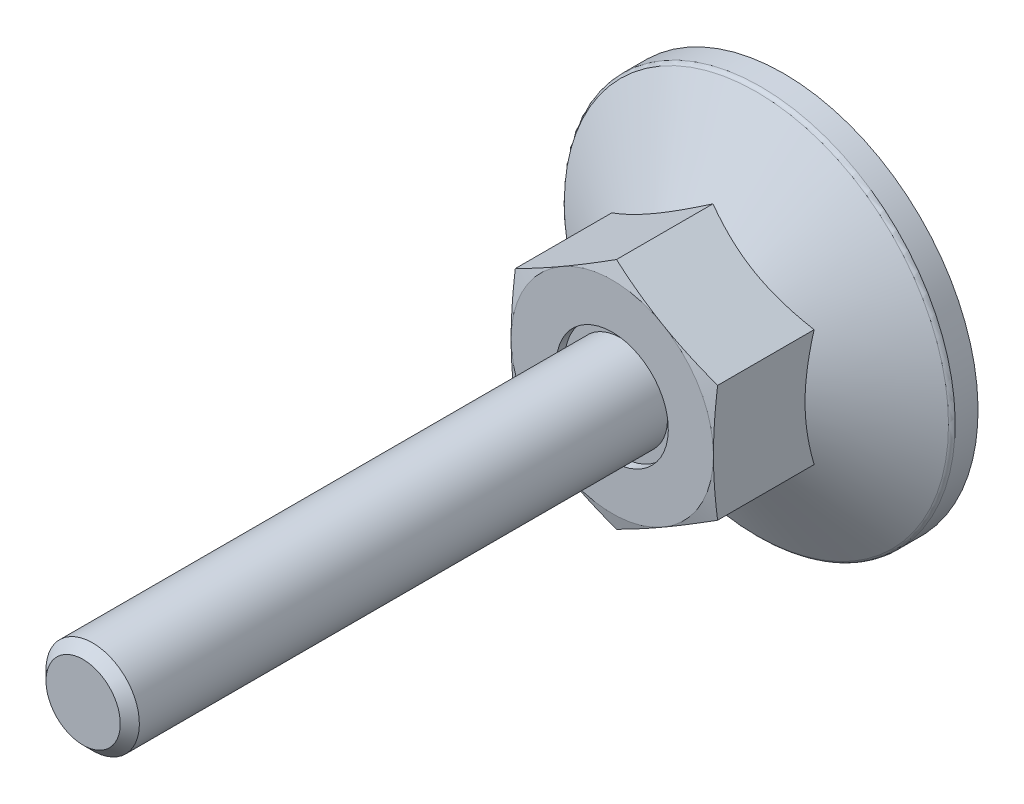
ISO-10303-21;
HEADER;
FILE_DESCRIPTION(('STEP AP214'),'2;1');
FILE_NAME('part.step','',(''),(''),'','','');
FILE_SCHEMA(('AUTOMOTIVE_DESIGN { 1 0 10303 214 1 1 1 1 }'));
ENDSEC;
DATA;
#1=APPLICATION_CONTEXT('core data for automotive mechanical design processes');
#2=APPLICATION_PROTOCOL_DEFINITION('international standard','automotive_design',2000,#1);
#3=PRODUCT_CONTEXT('',#1,'mechanical');
#4=PRODUCT('Part','Part','',(#3));
#5=PRODUCT_RELATED_PRODUCT_CATEGORY('part','',(#4));
#6=PRODUCT_DEFINITION_FORMATION('','',#4);
#7=PRODUCT_DEFINITION_CONTEXT('part definition',#1,'design');
#8=PRODUCT_DEFINITION('design','',#6,#7);
#9=PRODUCT_DEFINITION_SHAPE('','',#8);
#10=(LENGTH_UNIT() NAMED_UNIT(*) SI_UNIT(.MILLI.,.METRE.));
#11=(NAMED_UNIT(*) PLANE_ANGLE_UNIT() SI_UNIT($,.RADIAN.));
#12=(NAMED_UNIT(*) SI_UNIT($,.STERADIAN.) SOLID_ANGLE_UNIT());
#13=UNCERTAINTY_MEASURE_WITH_UNIT(LENGTH_MEASURE(1.E-05),#10,'distance_accuracy_value','');
#14=(GEOMETRIC_REPRESENTATION_CONTEXT(3) GLOBAL_UNCERTAINTY_ASSIGNED_CONTEXT((#13)) GLOBAL_UNIT_ASSIGNED_CONTEXT((#10,
#11,#12)) REPRESENTATION_CONTEXT('',''));
#15=CARTESIAN_POINT('',(0.,0.,0.));
#16=DIRECTION('',(0.,0.,1.));
#17=DIRECTION('',(1.,0.,0.));
#18=AXIS2_PLACEMENT_3D('',#15,#16,#17);
#19=CARTESIAN_POINT('',(0.,0.,10.45));
#20=DIRECTION('',(0.,0.,-1.));
#21=DIRECTION('',(0.,1.,0.));
#22=AXIS2_PLACEMENT_3D('',#19,#20,#21);
#23=PLANE('',#22);
#24=CARTESIAN_POINT('',(0.,0.,10.45));
#25=DIRECTION('',(0.,0.,-1.));
#26=DIRECTION('',(0.,1.,0.));
#27=AXIS2_PLACEMENT_3D('',#24,#25,#26);
#28=CIRCLE('',#27,3.6);
#29=CARTESIAN_POINT('',(0.,3.6,10.45));
#30=VERTEX_POINT('',#29);
#31=EDGE_CURVE('E27',#30,#30,#28,.T.);
#32=ORIENTED_EDGE('',*,*,#31,.F.);
#33=EDGE_LOOP('',(#32));
#34=FACE_BOUND('',#33,.T.);
#35=CARTESIAN_POINT('',(0.,0.,10.45));
#36=DIRECTION('',(0.,0.,-1.));
#37=DIRECTION('',(0.,1.,0.));
#38=AXIS2_PLACEMENT_3D('',#35,#36,#37);
#39=CIRCLE('',#38,3.);
#40=CARTESIAN_POINT('',(0.,3.,10.45));
#41=VERTEX_POINT('',#40);
#42=EDGE_CURVE('E252',#41,#41,#39,.F.);
#43=ORIENTED_EDGE('',*,*,#42,.F.);
#44=EDGE_LOOP('',(#43));
#45=FACE_BOUND('',#44,.T.);
#46=ADVANCED_FACE('F14',(#34,#45),#23,.F.);
#47=CARTESIAN_POINT('',(0.,7.5055534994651,22.));
#48=DIRECTION('',(0.499999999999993,-0.866025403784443,0.));
#49=DIRECTION('',(0.866025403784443,0.499999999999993,0.));
#50=AXIS2_PLACEMENT_3D('',#47,#48,#49);
#51=PLANE('',#50);
#52=CARTESIAN_POINT('',(-6.5002,3.75266127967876,4.53347836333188));
#53=CARTESIAN_POINT('',(-6.35732254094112,3.83515161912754,4.58109719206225));
#54=CARTESIAN_POINT('',(-6.21391236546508,3.91794952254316,4.62655491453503));
#55=CARTESIAN_POINT('',(-5.9259273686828,4.08421773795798,4.71255293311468));
#56=CARTESIAN_POINT('',(-5.78135207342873,4.16768832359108,4.7530911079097));
#57=CARTESIAN_POINT('',(-5.34531134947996,4.41943655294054,4.86653061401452));
#58=CARTESIAN_POINT('',(-5.05212471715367,4.58870793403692,4.93105380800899));
#59=CARTESIAN_POINT('',(-4.61337625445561,4.84201947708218,5.00671503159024));
#60=CARTESIAN_POINT('',(-4.46912536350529,4.92530276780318,5.02826875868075));
#61=CARTESIAN_POINT('',(-4.17997178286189,5.09224566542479,5.06441130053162));
#62=CARTESIAN_POINT('',(-4.03506915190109,5.17590523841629,5.07900073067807));
#63=CARTESIAN_POINT('',(-3.74501222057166,5.34336968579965,5.10084286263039));
#64=CARTESIAN_POINT('',(-3.59985839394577,5.42717428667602,5.10810389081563));
#65=CARTESIAN_POINT('',(-3.30942466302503,5.59485627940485,5.11514131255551));
#66=CARTESIAN_POINT('',(-3.16414476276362,5.67873366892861,5.11491793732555));
#67=CARTESIAN_POINT('',(-2.76612405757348,5.90853103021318,5.1040181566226));
#68=CARTESIAN_POINT('',(-2.51351353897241,6.05437578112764,5.08571979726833));
#69=CARTESIAN_POINT('',(-2.00997032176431,6.34509659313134,5.02769527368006));
#70=CARTESIAN_POINT('',(-1.75903939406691,6.48997163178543,4.9879492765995));
#71=CARTESIAN_POINT('',(-1.25448277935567,6.78127752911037,4.8885957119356));
#72=CARTESIAN_POINT('',(-1.00092075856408,6.92767163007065,4.82856718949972));
#73=CARTESIAN_POINT('',(-0.497578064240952,7.21827667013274,4.69232662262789));
#74=CARTESIAN_POINT('',(-0.247790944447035,7.36249133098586,4.61614658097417));
#75=CARTESIAN_POINT('',(0.000200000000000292,7.50566896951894,4.53347836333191));
#76=B_SPLINE_CURVE_WITH_KNOTS('',3,(#52,#53,#54,#55,#56,#57,#58,#59,#60,#61,#62,#63,#64,#65,#66,
#67,#68,#69,#70,#71,#72,#73,#74,#75),.UNSPECIFIED.,.F.,.F.,(4,2,2,2,2,2,2,2,2,2,2,4),(0.,
0.515105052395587,1.03043143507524,2.06322554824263,2.56697389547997,3.07067772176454,
3.57380860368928,4.07692394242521,4.95279354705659,5.82947446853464,6.72559912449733,
7.61996451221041),.UNSPECIFIED.);
#77=CARTESIAN_POINT('',(-6.5,3.7527767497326,4.53354503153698));
#78=VERTEX_POINT('',#77);
#79=CARTESIAN_POINT('',(0.,7.5055534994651,4.53354503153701));
#80=VERTEX_POINT('',#79);
#81=EDGE_CURVE('E100',#78,#80,#76,.T.);
#82=ORIENTED_EDGE('',*,*,#81,.F.);
#83=DIRECTION('',(0.,0.,-1.));
#84=VECTOR('',#83,1.);
#85=CARTESIAN_POINT('',(-6.5,3.7527767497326,22.));
#86=LINE('',#85,#84);
#87=CARTESIAN_POINT('',(-6.5,3.7527767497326,10.7305627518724));
#88=VERTEX_POINT('',#87);
#89=EDGE_CURVE('E91',#88,#78,#86,.T.);
#90=ORIENTED_EDGE('',*,*,#89,.F.);
#91=CARTESIAN_POINT('',(0.000200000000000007,7.50566896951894,10.7305318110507));
#92=CARTESIAN_POINT('',(-0.269745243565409,7.34981601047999,10.7723102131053));
#93=CARTESIAN_POINT('',(-0.540179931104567,7.19368047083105,10.8102381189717));
#94=CARTESIAN_POINT('',(-1.08200437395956,6.8808579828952,10.876873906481));
#95=CARTESIAN_POINT('',(-1.35339447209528,6.72417083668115,10.9055780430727));
#96=CARTESIAN_POINT('',(-1.89548428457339,6.41119513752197,10.952090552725));
#97=CARTESIAN_POINT('',(-2.16618033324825,6.25490870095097,10.9699543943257));
#98=CARTESIAN_POINT('',(-2.70791763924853,5.94213652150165,10.9939079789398));
#99=CARTESIAN_POINT('',(-2.97895881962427,5.78565082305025,11.));
#100=CARTESIAN_POINT('',(-3.52104118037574,5.47267942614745,11.));
#101=CARTESIAN_POINT('',(-3.79208236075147,5.31619372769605,10.9939079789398));
#102=CARTESIAN_POINT('',(-4.33381966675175,5.00342154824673,10.9699543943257));
#103=CARTESIAN_POINT('',(-4.60451571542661,4.84713511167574,10.952090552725));
#104=CARTESIAN_POINT('',(-5.14660552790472,4.53415941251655,10.9055780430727));
#105=CARTESIAN_POINT('',(-5.41799562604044,4.3774722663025,10.876873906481));
#106=CARTESIAN_POINT('',(-5.95982006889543,4.06464977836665,10.8102381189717));
#107=CARTESIAN_POINT('',(-6.23025475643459,3.90851423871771,10.7723102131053));
#108=CARTESIAN_POINT('',(-6.5002,3.75266127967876,10.7305318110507));
#109=B_SPLINE_CURVE_WITH_KNOTS('',3,(#91,#92,#93,#94,#95,#96,#97,#98,#99,#100,#101,#102,#103,
#104,#105,#106,#107,#108),.UNSPECIFIED.,.F.,.F.,(4,2,2,2,2,2,2,2,4),(0.,0.943529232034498,
1.88744107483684,2.82648138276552,3.76533995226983,4.70419852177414,5.64323882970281,
6.58715067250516,7.53067990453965),.UNSPECIFIED.);
#110=CARTESIAN_POINT('',(-3.24999999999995,5.62916512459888,11.));
#111=VERTEX_POINT('',#110);
#112=EDGE_CURVE('E191',#111,#88,#109,.T.);
#113=ORIENTED_EDGE('',*,*,#112,.F.);
#114=CARTESIAN_POINT('',(0.,7.5055534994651,10.7305627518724));
#115=VERTEX_POINT('',#114);
#116=EDGE_CURVE('E478',#115,#111,#109,.T.);
#117=ORIENTED_EDGE('',*,*,#116,.F.);
#118=DIRECTION('',(0.,0.,-1.));
#119=VECTOR('',#118,1.);
#120=CARTESIAN_POINT('',(0.,7.5055534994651,22.));
#121=LINE('',#120,#119);
#122=EDGE_CURVE('E104',#115,#80,#121,.T.);
#123=ORIENTED_EDGE('',*,*,#122,.T.);
#124=EDGE_LOOP('',(#82,#90,#113,#117,#123));
#125=FACE_BOUND('',#124,.T.);
#126=ADVANCED_FACE('F103',(#125),#51,.F.);
#127=CARTESIAN_POINT('',(6.5,3.7527767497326,22.));
#128=DIRECTION('',(-0.499999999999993,-0.866025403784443,0.));
#129=DIRECTION('',(0.866025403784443,-0.499999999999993,0.));
#130=AXIS2_PLACEMENT_3D('',#127,#128,#129);
#131=PLANE('',#130);
#132=CARTESIAN_POINT('',(-0.0002,7.50566896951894,4.53347836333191));
#133=CARTESIAN_POINT('',(0.142677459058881,7.42317863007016,4.58109719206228));
#134=CARTESIAN_POINT('',(0.286087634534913,7.34038072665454,4.62655491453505));
#135=CARTESIAN_POINT('',(0.574072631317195,7.17411251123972,4.71255293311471));
#136=CARTESIAN_POINT('',(0.718647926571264,7.09064192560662,4.75309110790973));
#137=CARTESIAN_POINT('',(1.15468865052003,6.83889369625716,4.86653061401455));
#138=CARTESIAN_POINT('',(1.44787528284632,6.66962231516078,4.93105380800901));
#139=CARTESIAN_POINT('',(1.88662374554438,6.41631077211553,5.00671503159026));
#140=CARTESIAN_POINT('',(2.03087463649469,6.33302748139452,5.02826875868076));
#141=CARTESIAN_POINT('',(2.32002821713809,6.16608458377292,5.06441130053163));
#142=CARTESIAN_POINT('',(2.46493084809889,6.08242501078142,5.07900073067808));
#143=CARTESIAN_POINT('',(2.75498777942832,5.91496056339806,5.10084286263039));
#144=CARTESIAN_POINT('',(2.90014160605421,5.8311559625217,5.10810389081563));
#145=CARTESIAN_POINT('',(3.19057533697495,5.66347396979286,5.11514131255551));
#146=CARTESIAN_POINT('',(3.33585523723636,5.5795965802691,5.11491793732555));
#147=CARTESIAN_POINT('',(3.73387594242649,5.34979921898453,5.10401815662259));
#148=CARTESIAN_POINT('',(3.98648646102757,5.20395446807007,5.08571979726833));
#149=CARTESIAN_POINT('',(4.49002967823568,4.91323365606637,5.02769527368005));
#150=CARTESIAN_POINT('',(4.74096060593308,4.76835861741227,4.98794927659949));
#151=CARTESIAN_POINT('',(5.24551722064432,4.47705272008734,4.88859571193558));
#152=CARTESIAN_POINT('',(5.49907924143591,4.33065861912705,4.8285671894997));
#153=CARTESIAN_POINT('',(6.00242193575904,4.04005357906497,4.69232662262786));
#154=CARTESIAN_POINT('',(6.25220905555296,3.89583891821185,4.61614658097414));
#155=CARTESIAN_POINT('',(6.5002,3.75266127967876,4.53347836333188));
#156=B_SPLINE_CURVE_WITH_KNOTS('',3,(#132,#133,#134,#135,#136,#137,#138,#139,#140,#141,#142,
#143,#144,#145,#146,#147,#148,#149,#150,#151,#152,#153,#154,#155),.UNSPECIFIED.,.F.,.F.,(4,2,2,
2,2,2,2,2,2,2,2,4),(0.,0.515105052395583,1.03043143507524,2.06322554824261,2.56697389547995,
3.07067772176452,3.57380860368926,4.07692394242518,4.95279354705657,5.82947446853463,
6.72559912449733,7.61996451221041),.UNSPECIFIED.);
#157=CARTESIAN_POINT('',(6.5,3.7527767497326,4.53354503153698));
#158=VERTEX_POINT('',#157);
#159=EDGE_CURVE('E34',#80,#158,#156,.T.);
#160=ORIENTED_EDGE('',*,*,#159,.F.);
#161=ORIENTED_EDGE('',*,*,#122,.F.);
#162=CARTESIAN_POINT('',(6.5002,3.75266127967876,10.7305318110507));
#163=CARTESIAN_POINT('',(6.23025475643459,3.90851423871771,10.7723102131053));
#164=CARTESIAN_POINT('',(5.95982006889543,4.06464977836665,10.8102381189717));
#165=CARTESIAN_POINT('',(5.41799562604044,4.37747226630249,10.876873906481));
#166=CARTESIAN_POINT('',(5.14660552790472,4.53415941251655,10.9055780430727));
#167=CARTESIAN_POINT('',(4.60451571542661,4.84713511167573,10.952090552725));
#168=CARTESIAN_POINT('',(4.33381966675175,5.00342154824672,10.9699543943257));
#169=CARTESIAN_POINT('',(3.79208236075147,5.31619372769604,10.9939079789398));
#170=CARTESIAN_POINT('',(3.52104118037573,5.47267942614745,11.));
#171=CARTESIAN_POINT('',(2.97895881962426,5.78565082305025,11.));
#172=CARTESIAN_POINT('',(2.70791763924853,5.94213652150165,10.9939079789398));
#173=CARTESIAN_POINT('',(2.16618033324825,6.25490870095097,10.9699543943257));
#174=CARTESIAN_POINT('',(1.89548428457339,6.41119513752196,10.952090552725));
#175=CARTESIAN_POINT('',(1.35339447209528,6.72417083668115,10.9055780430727));
#176=CARTESIAN_POINT('',(1.08200437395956,6.8808579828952,10.876873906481));
#177=CARTESIAN_POINT('',(0.540179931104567,7.19368047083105,10.8102381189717));
#178=CARTESIAN_POINT('',(0.26974524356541,7.34981601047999,10.7723102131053));
#179=CARTESIAN_POINT('',(-0.000199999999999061,7.50566896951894,10.7305318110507));
#180=B_SPLINE_CURVE_WITH_KNOTS('',3,(#162,#163,#164,#165,#166,#167,#168,#169,#170,#171,#172,
#173,#174,#175,#176,#177,#178,#179),.UNSPECIFIED.,.F.,.F.,(4,2,2,2,2,2,2,2,4),(0.,
0.943529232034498,1.88744107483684,2.82648138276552,3.76533995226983,4.70419852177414,
5.64323882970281,6.58715067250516,7.53067990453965),.UNSPECIFIED.);
#181=CARTESIAN_POINT('',(3.24999999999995,5.62916512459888,11.));
#182=VERTEX_POINT('',#181);
#183=EDGE_CURVE('E175',#182,#115,#180,.T.);
#184=ORIENTED_EDGE('',*,*,#183,.F.);
#185=CARTESIAN_POINT('',(6.5,3.7527767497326,10.7305627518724));
#186=VERTEX_POINT('',#185);
#187=EDGE_CURVE('E183',#186,#182,#180,.T.);
#188=ORIENTED_EDGE('',*,*,#187,.F.);
#189=DIRECTION('',(0.,0.,-1.));
#190=VECTOR('',#189,1.);
#191=CARTESIAN_POINT('',(6.5,3.7527767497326,22.));
#192=LINE('',#191,#190);
#193=EDGE_CURVE('E481',#186,#158,#192,.T.);
#194=ORIENTED_EDGE('',*,*,#193,.T.);
#195=EDGE_LOOP('',(#160,#161,#184,#188,#194));
#196=FACE_BOUND('',#195,.T.);
#197=ADVANCED_FACE('F165',(#196),#131,.F.);
#198=CARTESIAN_POINT('',(6.5,-3.7527767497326,22.));
#199=DIRECTION('',(-1.,0.,0.));
#200=DIRECTION('',(0.,-1.,0.));
#201=AXIS2_PLACEMENT_3D('',#198,#199,#200);
#202=PLANE('',#201);
#203=CARTESIAN_POINT('',(6.5,10.067414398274,1.94823609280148));
#204=CARTESIAN_POINT('',(6.5,9.78352438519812,2.0858958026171));
#205=CARTESIAN_POINT('',(6.5,9.49898106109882,2.22223138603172));
#206=CARTESIAN_POINT('',(6.5,8.9282401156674,2.49150895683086));
#207=CARTESIAN_POINT('',(6.5,8.64204224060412,2.62445040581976));
#208=CARTESIAN_POINT('',(6.5,8.06616487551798,2.88686541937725));
#209=CARTESIAN_POINT('',(6.5,7.77647490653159,3.01631606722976));
#210=CARTESIAN_POINT('',(6.5,7.19478507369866,3.26989907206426));
#211=CARTESIAN_POINT('',(6.5,6.90278532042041,3.3940316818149));
#212=CARTESIAN_POINT('',(6.5,6.30684739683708,3.6393457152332));
#213=CARTESIAN_POINT('',(6.5,6.00282105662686,3.76031411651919));
#214=CARTESIAN_POINT('',(6.5,5.39120706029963,3.99306391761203));
#215=CARTESIAN_POINT('',(6.5,5.08361900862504,4.10484428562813));
#216=CARTESIAN_POINT('',(6.5,4.46497231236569,4.31627594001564));
#217=CARTESIAN_POINT('',(6.5,4.15392216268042,4.41595183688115));
#218=CARTESIAN_POINT('',(6.5,3.52735818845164,4.59996747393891));
#219=CARTESIAN_POINT('',(6.5,3.21184580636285,4.6843120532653));
#220=CARTESIAN_POINT('',(6.5,2.57783458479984,4.83319256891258));
#221=CARTESIAN_POINT('',(6.5,2.25935972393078,4.8978289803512));
#222=CARTESIAN_POINT('',(6.5,1.61842059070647,5.00357646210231));
#223=CARTESIAN_POINT('',(6.5,1.29595672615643,5.04468991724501));
#224=CARTESIAN_POINT('',(6.5,0.812693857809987,5.08598811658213));
#225=CARTESIAN_POINT('',(6.5,0.652724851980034,5.09635596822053));
#226=CARTESIAN_POINT('',(6.5,0.332484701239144,5.110324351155));
#227=CARTESIAN_POINT('',(6.5,0.172213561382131,5.11392499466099));
#228=CARTESIAN_POINT('',(6.5,-0.148338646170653,5.11426557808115));
#229=CARTESIAN_POINT('',(6.5,-0.308619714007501,5.11100536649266));
#230=CARTESIAN_POINT('',(6.5,-0.628902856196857,5.09770543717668));
#231=CARTESIAN_POINT('',(6.5,-0.788904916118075,5.08766537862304));
#232=CARTESIAN_POINT('',(6.5,-1.1736673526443,5.05558094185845));
#233=CARTESIAN_POINT('',(6.5,-1.39816400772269,5.03030719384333));
#234=CARTESIAN_POINT('',(6.5,-1.84547349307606,4.96779217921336));
#235=CARTESIAN_POINT('',(6.5,-2.06828609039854,4.93054928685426));
#236=CARTESIAN_POINT('',(6.5,-2.73393776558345,4.80284369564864));
#237=CARTESIAN_POINT('',(6.5,-3.17375537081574,4.69642628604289));
#238=CARTESIAN_POINT('',(6.5,-3.83171733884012,4.51203063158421));
#239=CARTESIAN_POINT('',(6.5,-4.0532725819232,4.44552609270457));
#240=CARTESIAN_POINT('',(6.5,-4.49422901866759,4.30565892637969));
#241=CARTESIAN_POINT('',(6.5,-4.7136301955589,4.23229624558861));
#242=CARTESIAN_POINT('',(6.5,-5.15035386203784,4.07988627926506));
#243=CARTESIAN_POINT('',(6.5,-5.36767698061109,4.00084077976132));
#244=CARTESIAN_POINT('',(6.5,-5.800520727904,3.83799065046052));
#245=CARTESIAN_POINT('',(6.5,-6.01604140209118,3.75418614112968));
#246=CARTESIAN_POINT('',(6.5,-6.61842771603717,3.5135303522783));
#247=CARTESIAN_POINT('',(6.5,-7.00350435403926,3.35220459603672));
#248=CARTESIAN_POINT('',(6.5,-7.76959629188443,3.02014813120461));
#249=CARTESIAN_POINT('',(6.5,-8.15061109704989,2.84941629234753));
#250=CARTESIAN_POINT('',(6.5,-8.90957192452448,2.50088582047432));
#251=CARTESIAN_POINT('',(6.5,-9.28751663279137,2.32308433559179));
#252=CARTESIAN_POINT('',(6.5,-10.0408394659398,1.96218611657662));
#253=CARTESIAN_POINT('',(6.5,-10.4162177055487,1.77908962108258));
#254=CARTESIAN_POINT('',(6.5,-11.1655631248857,1.40849620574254));
#255=CARTESIAN_POINT('',(6.5,-11.5395269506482,1.22099251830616));
#256=CARTESIAN_POINT('',(6.5,-12.2858210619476,0.842758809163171));
#257=CARTESIAN_POINT('',(6.5,-12.6581513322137,0.652028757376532));
#258=CARTESIAN_POINT('',(6.5,-13.4013949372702,0.268043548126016));
#259=CARTESIAN_POINT('',(6.5,-13.7723085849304,0.0747889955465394));
#260=CARTESIAN_POINT('',(6.5,-14.5130449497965,-0.313800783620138));
#261=CARTESIAN_POINT('',(6.5,-14.8828676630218,-0.509136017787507));
#262=CARTESIAN_POINT('',(6.5,-15.9085714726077,-1.05391022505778));
#263=CARTESIAN_POINT('',(6.5,-16.5634819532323,-1.40517623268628));
#264=CARTESIAN_POINT('',(6.5,-17.871267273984,-2.11157255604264));
#265=CARTESIAN_POINT('',(6.5,-18.5241419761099,-2.46670312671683));
#266=CARTESIAN_POINT('',(6.5,-19.8261496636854,-3.17862531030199));
#267=CARTESIAN_POINT('',(6.5,-20.4752878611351,-3.53540739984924));
#268=CARTESIAN_POINT('',(6.5,-21.7722968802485,-4.25114422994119));
#269=CARTESIAN_POINT('',(6.5,-22.4201678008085,-4.61009879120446));
#270=CARTESIAN_POINT('',(6.5,-23.0675997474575,-4.9698379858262));
#271=B_SPLINE_CURVE_WITH_KNOTS('',3,(#203,#204,#205,#206,#207,#208,#209,#210,#211,#212,#213,
#214,#215,#216,#217,#218,#219,#220,#221,#222,#223,#224,#225,#226,#227,#228,#229,#230,#231,#232,
#233,#234,#235,#236,#237,#238,#239,#240,#241,#242,#243,#244,#245,#246,#247,#248,#249,#250,#251,
#252,#253,#254,#255,#256,#257,#258,#259,#260,#261,#262,#263,#264,#265,#266,#267,#268,#269,#270),
.UNSPECIFIED.,.F.,.F.,(4,2,2,2,2,2,2,2,2,2,2,2,2,2,2,2,2,2,2,2,2,2,2,2,2,2,2,2,2,2,2,2,2,4),(0.,
0.94652822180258,1.89320566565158,2.84505559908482,3.79686024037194,4.77837094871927,
5.75999172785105,6.73958204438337,7.71886262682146,8.69306383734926,9.66716626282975,
10.1479587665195,10.6287432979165,11.1095384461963,11.5903577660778,12.267719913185,
12.9451741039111,14.3007885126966,14.9946950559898,15.6886069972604,16.3823017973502,
17.0759790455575,18.3282990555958,19.5807698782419,20.8337511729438,22.086676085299,
23.3416700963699,24.5966758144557,25.8513861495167,27.1061010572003,29.3355785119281,
31.5652039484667,33.7873748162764,36.0093647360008),.UNSPECIFIED.);
#272=CARTESIAN_POINT('',(6.5,-3.7527767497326,4.53354503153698));
#273=VERTEX_POINT('',#272);
#274=EDGE_CURVE('E42',#158,#273,#271,.T.);
#275=ORIENTED_EDGE('',*,*,#274,.F.);
#276=ORIENTED_EDGE('',*,*,#193,.F.);
#277=CARTESIAN_POINT('',(6.5,9.92747995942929,9.56215186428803));
#278=CARTESIAN_POINT('',(6.5,9.63259364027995,9.62823955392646));
#279=CARTESIAN_POINT('',(6.5,9.33752287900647,9.69351898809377));
#280=CARTESIAN_POINT('',(6.5,8.74692189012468,9.82202506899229));
#281=CARTESIAN_POINT('',(6.5,8.45139164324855,9.88525162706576));
#282=CARTESIAN_POINT('',(6.5,7.85951636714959,10.0092707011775));
#283=CARTESIAN_POINT('',(6.5,7.56317082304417,10.0700607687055));
#284=CARTESIAN_POINT('',(6.5,6.9698629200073,10.1885506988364));
#285=CARTESIAN_POINT('',(6.5,6.67290056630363,10.2462505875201));
#286=CARTESIAN_POINT('',(6.5,6.08062010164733,10.3573796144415));
#287=CARTESIAN_POINT('',(6.5,5.78530770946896,10.410839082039));
#288=CARTESIAN_POINT('',(6.5,5.19387740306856,10.5130907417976));
#289=CARTESIAN_POINT('',(6.5,4.89775950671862,10.5618830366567));
#290=CARTESIAN_POINT('',(6.5,4.30466070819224,10.6537017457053));
#291=CARTESIAN_POINT('',(6.5,4.00767991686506,10.69672886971));
#292=CARTESIAN_POINT('',(6.5,3.41277328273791,10.7757492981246));
#293=CARTESIAN_POINT('',(6.5,3.11484743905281,10.8117425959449));
#294=CARTESIAN_POINT('',(6.5,2.51468954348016,10.8756761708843));
#295=CARTESIAN_POINT('',(6.5,2.21244707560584,10.9035201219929));
#296=CARTESIAN_POINT('',(6.5,1.60720229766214,10.9492341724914));
#297=CARTESIAN_POINT('',(6.5,1.30420000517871,10.9671045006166));
#298=CARTESIAN_POINT('',(6.5,0.697875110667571,10.9918290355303));
#299=CARTESIAN_POINT('',(6.5,0.394552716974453,10.9986882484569));
#300=CARTESIAN_POINT('',(6.5,-0.212135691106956,11.0009688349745));
#301=CARTESIAN_POINT('',(6.5,-0.515501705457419,10.9963902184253));
#302=CARTESIAN_POINT('',(6.5,-1.1229550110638,10.9760526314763));
#303=CARTESIAN_POINT('',(6.5,-1.42704091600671,10.9602530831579));
#304=CARTESIAN_POINT('',(6.5,-2.03449758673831,10.918375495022));
#305=CARTESIAN_POINT('',(6.5,-2.33786833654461,10.892297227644));
#306=CARTESIAN_POINT('',(6.5,-2.94389214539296,10.8311794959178));
#307=CARTESIAN_POINT('',(6.5,-3.24654460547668,10.7961341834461));
#308=CARTESIAN_POINT('',(6.5,-3.85087551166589,10.7185406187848));
#309=CARTESIAN_POINT('',(6.5,-4.15255395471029,10.6759923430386));
#310=CARTESIAN_POINT('',(6.5,-4.73502363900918,10.5877746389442));
#311=CARTESIAN_POINT('',(6.5,-5.01587505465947,10.5424985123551));
#312=CARTESIAN_POINT('',(6.5,-5.57683763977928,10.4475514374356));
#313=CARTESIAN_POINT('',(6.5,-5.85694878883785,10.3978803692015));
#314=CARTESIAN_POINT('',(6.5,-6.41653333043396,10.2949474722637));
#315=CARTESIAN_POINT('',(6.5,-6.69600666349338,10.2416853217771));
#316=CARTESIAN_POINT('',(6.5,-7.25437933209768,10.132225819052));
#317=CARTESIAN_POINT('',(6.5,-7.53327866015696,10.0760284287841));
#318=CARTESIAN_POINT('',(6.5,-8.36936246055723,9.90383082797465));
#319=CARTESIAN_POINT('',(6.5,-8.9258084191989,9.78424858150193));
#320=CARTESIAN_POINT('',(6.5,-10.0372205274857,9.53861051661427));
#321=CARTESIAN_POINT('',(6.5,-10.5921867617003,9.41255507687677));
#322=CARTESIAN_POINT('',(6.5,-11.6956125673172,9.15714489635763));
#323=CARTESIAN_POINT('',(6.5,-12.244082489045,9.02783474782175));
#324=CARTESIAN_POINT('',(6.5,-13.3402571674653,8.76597711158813));
#325=CARTESIAN_POINT('',(6.5,-13.8879619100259,8.6334295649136));
#326=CARTESIAN_POINT('',(6.5,-14.9821103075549,8.36610757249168));
#327=CARTESIAN_POINT('',(6.5,-15.528554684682,8.23133607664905));
#328=CARTESIAN_POINT('',(6.5,-16.6209674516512,7.95995280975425));
#329=CARTESIAN_POINT('',(6.5,-17.1669358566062,7.82334109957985));
#330=CARTESIAN_POINT('',(6.5,-17.7127383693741,7.6860776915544));
#331=B_SPLINE_CURVE_WITH_KNOTS('',3,(#277,#278,#279,#280,#281,#282,#283,#284,#285,#286,#287,
#288,#289,#290,#291,#292,#293,#294,#295,#296,#297,#298,#299,#300,#301,#302,#303,#304,#305,#306,
#307,#308,#309,#310,#311,#312,#313,#314,#315,#316,#317,#318,#319,#320,#321,#322,#323,#324,#325,
#326,#327,#328,#329,#330),.UNSPECIFIED.,.F.,.F.,(4,2,2,2,2,2,2,2,2,2,2,2,2,2,2,2,2,2,2,2,2,2,2,
2,2,2,4),(0.,0.906607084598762,1.8132532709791,2.72078883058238,3.62831672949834,
4.52862337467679,5.42891020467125,6.32908608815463,7.22926281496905,8.13968571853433,
9.05008774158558,9.96007573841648,10.8700629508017,11.7833577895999,12.6966728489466,
13.6105850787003,14.5245001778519,15.3778915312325,16.2313061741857,17.084797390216,
17.9382996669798,19.6456836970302,21.3529679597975,23.0434756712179,24.7340142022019,
26.4224665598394,28.1108631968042),.UNSPECIFIED.);
#332=CARTESIAN_POINT('',(6.5,0.,11.));
#333=VERTEX_POINT('',#332);
#334=EDGE_CURVE('E185',#333,#186,#331,.F.);
#335=ORIENTED_EDGE('',*,*,#334,.F.);
#336=CARTESIAN_POINT('',(6.5,-3.7527767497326,10.7305627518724));
#337=VERTEX_POINT('',#336);
#338=EDGE_CURVE('E184',#337,#333,#331,.F.);
#339=ORIENTED_EDGE('',*,*,#338,.F.);
#340=DIRECTION('',(0.,0.,-1.));
#341=VECTOR('',#340,1.);
#342=CARTESIAN_POINT('',(6.5,-3.7527767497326,22.));
#343=LINE('',#342,#341);
#344=EDGE_CURVE('E453',#337,#273,#343,.T.);
#345=ORIENTED_EDGE('',*,*,#344,.T.);
#346=EDGE_LOOP('',(#275,#276,#335,#339,#345));
#347=FACE_BOUND('',#346,.T.);
#348=ADVANCED_FACE('F169',(#347),#202,.F.);
#349=CARTESIAN_POINT('',(0.,-7.5055534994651,22.));
#350=DIRECTION('',(-0.499999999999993,0.866025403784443,0.));
#351=DIRECTION('',(-0.866025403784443,-0.499999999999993,0.));
#352=AXIS2_PLACEMENT_3D('',#349,#350,#351);
#353=PLANE('',#352);
#354=CARTESIAN_POINT('',(6.5002,-3.75266127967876,4.53347836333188));
#355=CARTESIAN_POINT('',(6.35732254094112,-3.83515161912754,4.58109719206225));
#356=CARTESIAN_POINT('',(6.21391236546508,-3.91794952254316,4.62655491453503));
#357=CARTESIAN_POINT('',(5.9259273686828,-4.08421773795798,4.71255293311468));
#358=CARTESIAN_POINT('',(5.78135207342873,-4.16768832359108,4.7530911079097));
#359=CARTESIAN_POINT('',(5.34531134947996,-4.41943655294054,4.86653061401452));
#360=CARTESIAN_POINT('',(5.05212471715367,-4.58870793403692,4.93105380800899));
#361=CARTESIAN_POINT('',(4.61337625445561,-4.84201947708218,5.00671503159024));
#362=CARTESIAN_POINT('',(4.46912536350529,-4.92530276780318,5.02826875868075));
#363=CARTESIAN_POINT('',(4.17997178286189,-5.09224566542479,5.06441130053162));
#364=CARTESIAN_POINT('',(4.03506915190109,-5.17590523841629,5.07900073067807));
#365=CARTESIAN_POINT('',(3.74501222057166,-5.34336968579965,5.10084286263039));
#366=CARTESIAN_POINT('',(3.59985839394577,-5.42717428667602,5.10810389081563));
#367=CARTESIAN_POINT('',(3.30942466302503,-5.59485627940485,5.11514131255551));
#368=CARTESIAN_POINT('',(3.16414476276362,-5.67873366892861,5.11491793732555));
#369=CARTESIAN_POINT('',(2.76612405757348,-5.90853103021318,5.1040181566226));
#370=CARTESIAN_POINT('',(2.51351353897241,-6.05437578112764,5.08571979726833));
#371=CARTESIAN_POINT('',(2.00997032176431,-6.34509659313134,5.02769527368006));
#372=CARTESIAN_POINT('',(1.75903939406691,-6.48997163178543,4.9879492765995));
#373=CARTESIAN_POINT('',(1.25448277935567,-6.78127752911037,4.8885957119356));
#374=CARTESIAN_POINT('',(1.00092075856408,-6.92767163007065,4.82856718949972));
#375=CARTESIAN_POINT('',(0.497578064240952,-7.21827667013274,4.69232662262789));
#376=CARTESIAN_POINT('',(0.247790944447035,-7.36249133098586,4.61614658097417));
#377=CARTESIAN_POINT('',(-0.000200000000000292,-7.50566896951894,4.53347836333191));
#378=B_SPLINE_CURVE_WITH_KNOTS('',3,(#354,#355,#356,#357,#358,#359,#360,#361,#362,#363,#364,
#365,#366,#367,#368,#369,#370,#371,#372,#373,#374,#375,#376,#377),.UNSPECIFIED.,.F.,.F.,(4,2,2,
2,2,2,2,2,2,2,2,4),(0.,0.515105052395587,1.03043143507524,2.06322554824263,2.56697389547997,
3.07067772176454,3.57380860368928,4.07692394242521,4.95279354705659,5.82947446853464,
6.72559912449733,7.61996451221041),.UNSPECIFIED.);
#379=CARTESIAN_POINT('',(0.,-7.5055534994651,4.53354503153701));
#380=VERTEX_POINT('',#379);
#381=EDGE_CURVE('E112',#273,#380,#378,.T.);
#382=ORIENTED_EDGE('',*,*,#381,.F.);
#383=ORIENTED_EDGE('',*,*,#344,.F.);
#384=CARTESIAN_POINT('',(-0.000200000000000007,-7.50566896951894,10.7305318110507));
#385=CARTESIAN_POINT('',(0.269745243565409,-7.34981601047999,10.7723102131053));
#386=CARTESIAN_POINT('',(0.540179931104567,-7.19368047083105,10.8102381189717));
#387=CARTESIAN_POINT('',(1.08200437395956,-6.8808579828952,10.876873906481));
#388=CARTESIAN_POINT('',(1.35339447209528,-6.72417083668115,10.9055780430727));
#389=CARTESIAN_POINT('',(1.89548428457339,-6.41119513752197,10.952090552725));
#390=CARTESIAN_POINT('',(2.16618033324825,-6.25490870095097,10.9699543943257));
#391=CARTESIAN_POINT('',(2.70791763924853,-5.94213652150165,10.9939079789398));
#392=CARTESIAN_POINT('',(2.97895881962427,-5.78565082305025,11.));
#393=CARTESIAN_POINT('',(3.52104118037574,-5.47267942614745,11.));
#394=CARTESIAN_POINT('',(3.79208236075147,-5.31619372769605,10.9939079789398));
#395=CARTESIAN_POINT('',(4.33381966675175,-5.00342154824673,10.9699543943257));
#396=CARTESIAN_POINT('',(4.60451571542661,-4.84713511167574,10.952090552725));
#397=CARTESIAN_POINT('',(5.14660552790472,-4.53415941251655,10.9055780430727));
#398=CARTESIAN_POINT('',(5.41799562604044,-4.3774722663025,10.876873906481));
#399=CARTESIAN_POINT('',(5.95982006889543,-4.06464977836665,10.8102381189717));
#400=CARTESIAN_POINT('',(6.23025475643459,-3.90851423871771,10.7723102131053));
#401=CARTESIAN_POINT('',(6.5002,-3.75266127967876,10.7305318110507));
#402=B_SPLINE_CURVE_WITH_KNOTS('',3,(#384,#385,#386,#387,#388,#389,#390,#391,#392,#393,#394,
#395,#396,#397,#398,#399,#400,#401),.UNSPECIFIED.,.F.,.F.,(4,2,2,2,2,2,2,2,4),(0.,
0.943529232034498,1.88744107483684,2.82648138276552,3.76533995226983,4.70419852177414,
5.64323882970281,6.58715067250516,7.53067990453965),.UNSPECIFIED.);
#403=CARTESIAN_POINT('',(3.24999999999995,-5.62916512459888,11.));
#404=VERTEX_POINT('',#403);
#405=EDGE_CURVE('E222',#404,#337,#402,.T.);
#406=ORIENTED_EDGE('',*,*,#405,.F.);
#407=CARTESIAN_POINT('',(0.,-7.5055534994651,10.7305627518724));
#408=VERTEX_POINT('',#407);
#409=EDGE_CURVE('E228',#408,#404,#402,.T.);
#410=ORIENTED_EDGE('',*,*,#409,.F.);
#411=DIRECTION('',(0.,0.,-1.));
#412=VECTOR('',#411,1.);
#413=CARTESIAN_POINT('',(0.,-7.5055534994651,22.));
#414=LINE('',#413,#412);
#415=EDGE_CURVE('E483',#408,#380,#414,.T.);
#416=ORIENTED_EDGE('',*,*,#415,.T.);
#417=EDGE_LOOP('',(#382,#383,#406,#410,#416));
#418=FACE_BOUND('',#417,.T.);
#419=ADVANCED_FACE('F230',(#418),#353,.F.);
#420=CARTESIAN_POINT('',(-6.5,-3.7527767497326,22.));
#421=DIRECTION('',(0.499999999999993,0.866025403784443,0.));
#422=DIRECTION('',(-0.866025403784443,0.499999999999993,0.));
#423=AXIS2_PLACEMENT_3D('',#420,#421,#422);
#424=PLANE('',#423);
#425=CARTESIAN_POINT('',(0.0002,-7.50566896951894,4.53347836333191));
#426=CARTESIAN_POINT('',(-0.142677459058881,-7.42317863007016,4.58109719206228));
#427=CARTESIAN_POINT('',(-0.286087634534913,-7.34038072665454,4.62655491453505));
#428=CARTESIAN_POINT('',(-0.574072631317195,-7.17411251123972,4.71255293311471));
#429=CARTESIAN_POINT('',(-0.718647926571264,-7.09064192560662,4.75309110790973));
#430=CARTESIAN_POINT('',(-1.15468865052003,-6.83889369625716,4.86653061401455));
#431=CARTESIAN_POINT('',(-1.44787528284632,-6.66962231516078,4.93105380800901));
#432=CARTESIAN_POINT('',(-1.88662374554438,-6.41631077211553,5.00671503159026));
#433=CARTESIAN_POINT('',(-2.03087463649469,-6.33302748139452,5.02826875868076));
#434=CARTESIAN_POINT('',(-2.32002821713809,-6.16608458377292,5.06441130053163));
#435=CARTESIAN_POINT('',(-2.46493084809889,-6.08242501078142,5.07900073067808));
#436=CARTESIAN_POINT('',(-2.75498777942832,-5.91496056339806,5.10084286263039));
#437=CARTESIAN_POINT('',(-2.90014160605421,-5.8311559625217,5.10810389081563));
#438=CARTESIAN_POINT('',(-3.19057533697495,-5.66347396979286,5.11514131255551));
#439=CARTESIAN_POINT('',(-3.33585523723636,-5.5795965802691,5.11491793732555));
#440=CARTESIAN_POINT('',(-3.73387594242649,-5.34979921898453,5.10401815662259));
#441=CARTESIAN_POINT('',(-3.98648646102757,-5.20395446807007,5.08571979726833));
#442=CARTESIAN_POINT('',(-4.49002967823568,-4.91323365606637,5.02769527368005));
#443=CARTESIAN_POINT('',(-4.74096060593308,-4.76835861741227,4.98794927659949));
#444=CARTESIAN_POINT('',(-5.24551722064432,-4.47705272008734,4.88859571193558));
#445=CARTESIAN_POINT('',(-5.49907924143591,-4.33065861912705,4.8285671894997));
#446=CARTESIAN_POINT('',(-6.00242193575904,-4.04005357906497,4.69232662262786));
#447=CARTESIAN_POINT('',(-6.25220905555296,-3.89583891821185,4.61614658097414));
#448=CARTESIAN_POINT('',(-6.5002,-3.75266127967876,4.53347836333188));
#449=B_SPLINE_CURVE_WITH_KNOTS('',3,(#425,#426,#427,#428,#429,#430,#431,#432,#433,#434,#435,
#436,#437,#438,#439,#440,#441,#442,#443,#444,#445,#446,#447,#448),.UNSPECIFIED.,.F.,.F.,(4,2,2,
2,2,2,2,2,2,2,2,4),(0.,0.515105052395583,1.03043143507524,2.06322554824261,2.56697389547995,
3.07067772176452,3.57380860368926,4.07692394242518,4.95279354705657,5.82947446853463,
6.72559912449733,7.61996451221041),.UNSPECIFIED.);
#450=CARTESIAN_POINT('',(-6.5,-3.7527767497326,4.53354503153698));
#451=VERTEX_POINT('',#450);
#452=EDGE_CURVE('E110',#380,#451,#449,.T.);
#453=ORIENTED_EDGE('',*,*,#452,.F.);
#454=ORIENTED_EDGE('',*,*,#415,.F.);
#455=CARTESIAN_POINT('',(-6.5002,-3.75266127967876,10.7305318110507));
#456=CARTESIAN_POINT('',(-6.23025475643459,-3.90851423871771,10.7723102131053));
#457=CARTESIAN_POINT('',(-5.95982006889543,-4.06464977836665,10.8102381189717));
#458=CARTESIAN_POINT('',(-5.41799562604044,-4.37747226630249,10.876873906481));
#459=CARTESIAN_POINT('',(-5.14660552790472,-4.53415941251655,10.9055780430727));
#460=CARTESIAN_POINT('',(-4.60451571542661,-4.84713511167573,10.952090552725));
#461=CARTESIAN_POINT('',(-4.33381966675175,-5.00342154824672,10.9699543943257));
#462=CARTESIAN_POINT('',(-3.79208236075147,-5.31619372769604,10.9939079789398));
#463=CARTESIAN_POINT('',(-3.52104118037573,-5.47267942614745,11.));
#464=CARTESIAN_POINT('',(-2.97895881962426,-5.78565082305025,11.));
#465=CARTESIAN_POINT('',(-2.70791763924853,-5.94213652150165,10.9939079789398));
#466=CARTESIAN_POINT('',(-2.16618033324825,-6.25490870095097,10.9699543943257));
#467=CARTESIAN_POINT('',(-1.89548428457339,-6.41119513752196,10.952090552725));
#468=CARTESIAN_POINT('',(-1.35339447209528,-6.72417083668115,10.9055780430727));
#469=CARTESIAN_POINT('',(-1.08200437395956,-6.8808579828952,10.876873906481));
#470=CARTESIAN_POINT('',(-0.540179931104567,-7.19368047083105,10.8102381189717));
#471=CARTESIAN_POINT('',(-0.26974524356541,-7.34981601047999,10.7723102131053));
#472=CARTESIAN_POINT('',(0.000199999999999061,-7.50566896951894,10.7305318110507));
#473=B_SPLINE_CURVE_WITH_KNOTS('',3,(#455,#456,#457,#458,#459,#460,#461,#462,#463,#464,#465,
#466,#467,#468,#469,#470,#471,#472),.UNSPECIFIED.,.F.,.F.,(4,2,2,2,2,2,2,2,4),(0.,
0.943529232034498,1.88744107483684,2.82648138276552,3.76533995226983,4.70419852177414,
5.64323882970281,6.58715067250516,7.53067990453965),.UNSPECIFIED.);
#474=CARTESIAN_POINT('',(-3.24999999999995,-5.62916512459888,11.));
#475=VERTEX_POINT('',#474);
#476=EDGE_CURVE('E216',#475,#408,#473,.T.);
#477=ORIENTED_EDGE('',*,*,#476,.F.);
#478=CARTESIAN_POINT('',(-6.5,-3.7527767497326,10.7305627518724));
#479=VERTEX_POINT('',#478);
#480=EDGE_CURVE('E229',#479,#475,#473,.T.);
#481=ORIENTED_EDGE('',*,*,#480,.F.);
#482=DIRECTION('',(0.,0.,-1.));
#483=VECTOR('',#482,1.);
#484=CARTESIAN_POINT('',(-6.5,-3.7527767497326,22.));
#485=LINE('',#484,#483);
#486=EDGE_CURVE('E99',#479,#451,#485,.T.);
#487=ORIENTED_EDGE('',*,*,#486,.T.);
#488=EDGE_LOOP('',(#453,#454,#477,#481,#487));
#489=FACE_BOUND('',#488,.T.);
#490=ADVANCED_FACE('F134',(#489),#424,.F.);
#491=CARTESIAN_POINT('',(-6.5,3.7527767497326,22.));
#492=DIRECTION('',(1.,0.,0.));
#493=DIRECTION('',(0.,1.,0.));
#494=AXIS2_PLACEMENT_3D('',#491,#492,#493);
#495=PLANE('',#494);
#496=CARTESIAN_POINT('',(-6.5,10.067414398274,1.94823609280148));
#497=CARTESIAN_POINT('',(-6.5,9.78352438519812,2.0858958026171));
#498=CARTESIAN_POINT('',(-6.5,9.49898106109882,2.22223138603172));
#499=CARTESIAN_POINT('',(-6.5,8.9282401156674,2.49150895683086));
#500=CARTESIAN_POINT('',(-6.5,8.64204224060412,2.62445040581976));
#501=CARTESIAN_POINT('',(-6.5,8.06616487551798,2.88686541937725));
#502=CARTESIAN_POINT('',(-6.5,7.77647490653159,3.01631606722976));
#503=CARTESIAN_POINT('',(-6.5,7.19478507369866,3.26989907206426));
#504=CARTESIAN_POINT('',(-6.5,6.90278532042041,3.3940316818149));
#505=CARTESIAN_POINT('',(-6.5,6.30684739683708,3.6393457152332));
#506=CARTESIAN_POINT('',(-6.5,6.00282105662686,3.76031411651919));
#507=CARTESIAN_POINT('',(-6.5,5.39120706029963,3.99306391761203));
#508=CARTESIAN_POINT('',(-6.5,5.08361900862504,4.10484428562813));
#509=CARTESIAN_POINT('',(-6.5,4.46497231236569,4.31627594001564));
#510=CARTESIAN_POINT('',(-6.5,4.15392216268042,4.41595183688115));
#511=CARTESIAN_POINT('',(-6.5,3.52735818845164,4.59996747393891));
#512=CARTESIAN_POINT('',(-6.5,3.21184580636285,4.6843120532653));
#513=CARTESIAN_POINT('',(-6.5,2.57783458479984,4.83319256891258));
#514=CARTESIAN_POINT('',(-6.5,2.25935972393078,4.8978289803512));
#515=CARTESIAN_POINT('',(-6.5,1.61842059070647,5.00357646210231));
#516=CARTESIAN_POINT('',(-6.5,1.29595672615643,5.04468991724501));
#517=CARTESIAN_POINT('',(-6.5,0.812693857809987,5.08598811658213));
#518=CARTESIAN_POINT('',(-6.5,0.652724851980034,5.09635596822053));
#519=CARTESIAN_POINT('',(-6.5,0.332484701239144,5.110324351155));
#520=CARTESIAN_POINT('',(-6.5,0.172213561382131,5.11392499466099));
#521=CARTESIAN_POINT('',(-6.5,-0.148338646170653,5.11426557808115));
#522=CARTESIAN_POINT('',(-6.5,-0.308619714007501,5.11100536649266));
#523=CARTESIAN_POINT('',(-6.5,-0.628902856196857,5.09770543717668));
#524=CARTESIAN_POINT('',(-6.5,-0.788904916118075,5.08766537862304));
#525=CARTESIAN_POINT('',(-6.5,-1.1736673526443,5.05558094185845));
#526=CARTESIAN_POINT('',(-6.5,-1.39816400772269,5.03030719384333));
#527=CARTESIAN_POINT('',(-6.5,-1.84547349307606,4.96779217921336));
#528=CARTESIAN_POINT('',(-6.5,-2.06828609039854,4.93054928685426));
#529=CARTESIAN_POINT('',(-6.5,-2.73393776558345,4.80284369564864));
#530=CARTESIAN_POINT('',(-6.5,-3.17375537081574,4.69642628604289));
#531=CARTESIAN_POINT('',(-6.5,-3.83171733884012,4.51203063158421));
#532=CARTESIAN_POINT('',(-6.5,-4.0532725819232,4.44552609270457));
#533=CARTESIAN_POINT('',(-6.5,-4.49422901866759,4.30565892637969));
#534=CARTESIAN_POINT('',(-6.5,-4.7136301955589,4.23229624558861));
#535=CARTESIAN_POINT('',(-6.5,-5.15035386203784,4.07988627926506));
#536=CARTESIAN_POINT('',(-6.5,-5.36767698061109,4.00084077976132));
#537=CARTESIAN_POINT('',(-6.5,-5.800520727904,3.83799065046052));
#538=CARTESIAN_POINT('',(-6.5,-6.01604140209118,3.75418614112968));
#539=CARTESIAN_POINT('',(-6.5,-6.61842771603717,3.5135303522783));
#540=CARTESIAN_POINT('',(-6.5,-7.00350435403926,3.35220459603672));
#541=CARTESIAN_POINT('',(-6.5,-7.76959629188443,3.02014813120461));
#542=CARTESIAN_POINT('',(-6.5,-8.15061109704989,2.84941629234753));
#543=CARTESIAN_POINT('',(-6.5,-8.90957192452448,2.50088582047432));
#544=CARTESIAN_POINT('',(-6.5,-9.28751663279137,2.32308433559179));
#545=CARTESIAN_POINT('',(-6.5,-10.0408394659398,1.96218611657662));
#546=CARTESIAN_POINT('',(-6.5,-10.4162177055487,1.77908962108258));
#547=CARTESIAN_POINT('',(-6.5,-11.1655631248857,1.40849620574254));
#548=CARTESIAN_POINT('',(-6.5,-11.5395269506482,1.22099251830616));
#549=CARTESIAN_POINT('',(-6.5,-12.2858210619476,0.842758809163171));
#550=CARTESIAN_POINT('',(-6.5,-12.6581513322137,0.652028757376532));
#551=CARTESIAN_POINT('',(-6.5,-13.4013949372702,0.268043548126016));
#552=CARTESIAN_POINT('',(-6.5,-13.7723085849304,0.0747889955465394));
#553=CARTESIAN_POINT('',(-6.5,-14.5130449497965,-0.313800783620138));
#554=CARTESIAN_POINT('',(-6.5,-14.8828676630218,-0.509136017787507));
#555=CARTESIAN_POINT('',(-6.5,-15.9085714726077,-1.05391022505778));
#556=CARTESIAN_POINT('',(-6.5,-16.5634819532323,-1.40517623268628));
#557=CARTESIAN_POINT('',(-6.5,-17.871267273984,-2.11157255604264));
#558=CARTESIAN_POINT('',(-6.5,-18.5241419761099,-2.46670312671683));
#559=CARTESIAN_POINT('',(-6.5,-19.8261496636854,-3.17862531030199));
#560=CARTESIAN_POINT('',(-6.5,-20.4752878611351,-3.53540739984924));
#561=CARTESIAN_POINT('',(-6.5,-21.7722968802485,-4.25114422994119));
#562=CARTESIAN_POINT('',(-6.5,-22.4201678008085,-4.61009879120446));
#563=CARTESIAN_POINT('',(-6.5,-23.0675997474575,-4.9698379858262));
#564=B_SPLINE_CURVE_WITH_KNOTS('',3,(#496,#497,#498,#499,#500,#501,#502,#503,#504,#505,#506,
#507,#508,#509,#510,#511,#512,#513,#514,#515,#516,#517,#518,#519,#520,#521,#522,#523,#524,#525,
#526,#527,#528,#529,#530,#531,#532,#533,#534,#535,#536,#537,#538,#539,#540,#541,#542,#543,#544,
#545,#546,#547,#548,#549,#550,#551,#552,#553,#554,#555,#556,#557,#558,#559,#560,#561,#562,#563),
.UNSPECIFIED.,.F.,.F.,(4,2,2,2,2,2,2,2,2,2,2,2,2,2,2,2,2,2,2,2,2,2,2,2,2,2,2,2,2,2,2,2,2,4),(0.,
0.94652822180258,1.89320566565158,2.84505559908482,3.79686024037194,4.77837094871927,
5.75999172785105,6.73958204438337,7.71886262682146,8.69306383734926,9.66716626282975,
10.1479587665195,10.6287432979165,11.1095384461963,11.5903577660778,12.267719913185,
12.9451741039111,14.3007885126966,14.9946950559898,15.6886069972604,16.3823017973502,
17.0759790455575,18.3282990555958,19.5807698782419,20.8337511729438,22.086676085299,
23.3416700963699,24.5966758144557,25.8513861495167,27.1061010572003,29.3355785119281,
31.5652039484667,33.7873748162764,36.0093647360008),.UNSPECIFIED.);
#565=EDGE_CURVE('E9',#451,#78,#564,.F.);
#566=ORIENTED_EDGE('',*,*,#565,.F.);
#567=ORIENTED_EDGE('',*,*,#486,.F.);
#568=CARTESIAN_POINT('',(-6.5,9.92747995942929,9.56215186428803));
#569=CARTESIAN_POINT('',(-6.5,9.63259364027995,9.62823955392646));
#570=CARTESIAN_POINT('',(-6.5,9.33752287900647,9.69351898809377));
#571=CARTESIAN_POINT('',(-6.5,8.74692189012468,9.82202506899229));
#572=CARTESIAN_POINT('',(-6.5,8.45139164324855,9.88525162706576));
#573=CARTESIAN_POINT('',(-6.5,7.85951636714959,10.0092707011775));
#574=CARTESIAN_POINT('',(-6.5,7.56317082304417,10.0700607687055));
#575=CARTESIAN_POINT('',(-6.5,6.9698629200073,10.1885506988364));
#576=CARTESIAN_POINT('',(-6.5,6.67290056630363,10.2462505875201));
#577=CARTESIAN_POINT('',(-6.5,6.08062010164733,10.3573796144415));
#578=CARTESIAN_POINT('',(-6.5,5.78530770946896,10.410839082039));
#579=CARTESIAN_POINT('',(-6.5,5.19387740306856,10.5130907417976));
#580=CARTESIAN_POINT('',(-6.5,4.89775950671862,10.5618830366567));
#581=CARTESIAN_POINT('',(-6.5,4.30466070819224,10.6537017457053));
#582=CARTESIAN_POINT('',(-6.5,4.00767991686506,10.69672886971));
#583=CARTESIAN_POINT('',(-6.5,3.41277328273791,10.7757492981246));
#584=CARTESIAN_POINT('',(-6.5,3.11484743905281,10.8117425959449));
#585=CARTESIAN_POINT('',(-6.5,2.51468954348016,10.8756761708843));
#586=CARTESIAN_POINT('',(-6.5,2.21244707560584,10.9035201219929));
#587=CARTESIAN_POINT('',(-6.5,1.60720229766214,10.9492341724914));
#588=CARTESIAN_POINT('',(-6.5,1.30420000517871,10.9671045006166));
#589=CARTESIAN_POINT('',(-6.5,0.697875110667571,10.9918290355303));
#590=CARTESIAN_POINT('',(-6.5,0.394552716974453,10.9986882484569));
#591=CARTESIAN_POINT('',(-6.5,-0.212135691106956,11.0009688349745));
#592=CARTESIAN_POINT('',(-6.5,-0.515501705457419,10.9963902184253));
#593=CARTESIAN_POINT('',(-6.5,-1.1229550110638,10.9760526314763));
#594=CARTESIAN_POINT('',(-6.5,-1.42704091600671,10.9602530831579));
#595=CARTESIAN_POINT('',(-6.5,-2.03449758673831,10.918375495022));
#596=CARTESIAN_POINT('',(-6.5,-2.33786833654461,10.892297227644));
#597=CARTESIAN_POINT('',(-6.5,-2.94389214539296,10.8311794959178));
#598=CARTESIAN_POINT('',(-6.5,-3.24654460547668,10.7961341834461));
#599=CARTESIAN_POINT('',(-6.5,-3.85087551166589,10.7185406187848));
#600=CARTESIAN_POINT('',(-6.5,-4.15255395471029,10.6759923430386));
#601=CARTESIAN_POINT('',(-6.5,-4.73502363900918,10.5877746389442));
#602=CARTESIAN_POINT('',(-6.5,-5.01587505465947,10.5424985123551));
#603=CARTESIAN_POINT('',(-6.5,-5.57683763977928,10.4475514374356));
#604=CARTESIAN_POINT('',(-6.5,-5.85694878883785,10.3978803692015));
#605=CARTESIAN_POINT('',(-6.5,-6.41653333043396,10.2949474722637));
#606=CARTESIAN_POINT('',(-6.5,-6.69600666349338,10.2416853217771));
#607=CARTESIAN_POINT('',(-6.5,-7.25437933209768,10.132225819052));
#608=CARTESIAN_POINT('',(-6.5,-7.53327866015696,10.0760284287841));
#609=CARTESIAN_POINT('',(-6.5,-8.36936246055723,9.90383082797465));
#610=CARTESIAN_POINT('',(-6.5,-8.9258084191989,9.78424858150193));
#611=CARTESIAN_POINT('',(-6.5,-10.0372205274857,9.53861051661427));
#612=CARTESIAN_POINT('',(-6.5,-10.5921867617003,9.41255507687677));
#613=CARTESIAN_POINT('',(-6.5,-11.6956125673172,9.15714489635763));
#614=CARTESIAN_POINT('',(-6.5,-12.244082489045,9.02783474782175));
#615=CARTESIAN_POINT('',(-6.5,-13.3402571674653,8.76597711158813));
#616=CARTESIAN_POINT('',(-6.5,-13.8879619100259,8.6334295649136));
#617=CARTESIAN_POINT('',(-6.5,-14.9821103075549,8.36610757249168));
#618=CARTESIAN_POINT('',(-6.5,-15.528554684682,8.23133607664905));
#619=CARTESIAN_POINT('',(-6.5,-16.6209674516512,7.95995280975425));
#620=CARTESIAN_POINT('',(-6.5,-17.1669358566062,7.82334109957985));
#621=CARTESIAN_POINT('',(-6.5,-17.7127383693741,7.6860776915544));
#622=B_SPLINE_CURVE_WITH_KNOTS('',3,(#568,#569,#570,#571,#572,#573,#574,#575,#576,#577,#578,
#579,#580,#581,#582,#583,#584,#585,#586,#587,#588,#589,#590,#591,#592,#593,#594,#595,#596,#597,
#598,#599,#600,#601,#602,#603,#604,#605,#606,#607,#608,#609,#610,#611,#612,#613,#614,#615,#616,
#617,#618,#619,#620,#621),.UNSPECIFIED.,.F.,.F.,(4,2,2,2,2,2,2,2,2,2,2,2,2,2,2,2,2,2,2,2,2,2,2,
2,2,2,4),(0.,0.906607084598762,1.8132532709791,2.72078883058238,3.62831672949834,
4.52862337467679,5.42891020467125,6.32908608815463,7.22926281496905,8.13968571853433,
9.05008774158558,9.96007573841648,10.8700629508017,11.7833577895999,12.6966728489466,
13.6105850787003,14.5245001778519,15.3778915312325,16.2313061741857,17.084797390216,
17.9382996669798,19.6456836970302,21.3529679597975,23.0434756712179,24.7340142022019,
26.4224665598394,28.1108631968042),.UNSPECIFIED.);
#623=CARTESIAN_POINT('',(-6.5,0.,11.));
#624=VERTEX_POINT('',#623);
#625=EDGE_CURVE('E207',#624,#479,#622,.T.);
#626=ORIENTED_EDGE('',*,*,#625,.F.);
#627=EDGE_CURVE('E96',#88,#624,#622,.T.);
#628=ORIENTED_EDGE('',*,*,#627,.F.);
#629=ORIENTED_EDGE('',*,*,#89,.T.);
#630=EDGE_LOOP('',(#566,#567,#626,#628,#629));
#631=FACE_BOUND('',#630,.T.);
#632=ADVANCED_FACE('F93',(#631),#495,.F.);
#633=CARTESIAN_POINT('',(0.,0.,11.));
#634=DIRECTION('',(0.,0.,-1.));
#635=DIRECTION('',(0.,1.,0.));
#636=AXIS2_PLACEMENT_3D('',#633,#634,#635);
#637=CONICAL_SURFACE('',#636,6.5,1.30899693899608);
#638=ORIENTED_EDGE('',*,*,#405,.T.);
#639=ORIENTED_EDGE('',*,*,#338,.T.);
#640=CARTESIAN_POINT('',(0.,0.,11.));
#641=DIRECTION('',(0.,0.,-1.));
#642=DIRECTION('',(0.,1.,0.));
#643=AXIS2_PLACEMENT_3D('',#640,#641,#642);
#644=CIRCLE('',#643,6.5);
#645=EDGE_CURVE('E450',#333,#404,#644,.T.);
#646=ORIENTED_EDGE('',*,*,#645,.T.);
#647=EDGE_LOOP('',(#638,#639,#646));
#648=FACE_BOUND('',#647,.T.);
#649=ADVANCED_FACE('F202',(#648),#637,.T.);
#650=EDGE_CURVE('E465',#182,#333,#644,.T.);
#651=ORIENTED_EDGE('',*,*,#650,.T.);
#652=ORIENTED_EDGE('',*,*,#334,.T.);
#653=ORIENTED_EDGE('',*,*,#187,.T.);
#654=EDGE_LOOP('',(#651,#652,#653));
#655=FACE_BOUND('',#654,.T.);
#656=ADVANCED_FACE('F377',(#655),#637,.T.);
#657=EDGE_CURVE('E474',#111,#182,#644,.T.);
#658=ORIENTED_EDGE('',*,*,#657,.T.);
#659=ORIENTED_EDGE('',*,*,#183,.T.);
#660=ORIENTED_EDGE('',*,*,#116,.T.);
#661=EDGE_LOOP('',(#658,#659,#660));
#662=FACE_BOUND('',#661,.T.);
#663=ADVANCED_FACE('F370',(#662),#637,.T.);
#664=ORIENTED_EDGE('',*,*,#476,.T.);
#665=ORIENTED_EDGE('',*,*,#409,.T.);
#666=EDGE_CURVE('E457',#404,#475,#644,.T.);
#667=ORIENTED_EDGE('',*,*,#666,.T.);
#668=EDGE_LOOP('',(#664,#665,#667));
#669=FACE_BOUND('',#668,.T.);
#670=ADVANCED_FACE('F363',(#669),#637,.T.);
#671=EDGE_CURVE('E466',#624,#111,#644,.T.);
#672=ORIENTED_EDGE('',*,*,#671,.T.);
#673=ORIENTED_EDGE('',*,*,#112,.T.);
#674=ORIENTED_EDGE('',*,*,#627,.T.);
#675=EDGE_LOOP('',(#672,#673,#674));
#676=FACE_BOUND('',#675,.T.);
#677=ADVANCED_FACE('F203',(#676),#637,.T.);
#678=CARTESIAN_POINT('',(0.,0.,0.));
#679=DIRECTION('',(0.,0.,-1.));
#680=DIRECTION('',(0.,1.,0.));
#681=AXIS2_PLACEMENT_3D('',#678,#679,#680);
#682=CYLINDRICAL_SURFACE('',#681,3.6);
#683=CARTESIAN_POINT('',(0.,0.,11.));
#684=DIRECTION('',(0.,0.,-1.));
#685=DIRECTION('',(0.,1.,0.));
#686=AXIS2_PLACEMENT_3D('',#683,#684,#685);
#687=CIRCLE('',#686,3.6);
#688=CARTESIAN_POINT('',(0.,3.6,11.));
#689=VERTEX_POINT('',#688);
#690=EDGE_CURVE('E464',#689,#689,#687,.T.);
#691=ORIENTED_EDGE('',*,*,#690,.F.);
#692=EDGE_LOOP('',(#691));
#693=FACE_BOUND('',#692,.T.);
#694=ORIENTED_EDGE('',*,*,#31,.T.);
#695=EDGE_LOOP('',(#694));
#696=FACE_BOUND('',#695,.T.);
#697=ADVANCED_FACE('F350',(#693,#696),#682,.F.);
#698=CARTESIAN_POINT('',(3.6,0.,11.));
#699=DIRECTION('',(0.,0.,-1.));
#700=DIRECTION('',(0.,1.,0.));
#701=AXIS2_PLACEMENT_3D('',#698,#699,#700);
#702=PLANE('',#701);
#703=ORIENTED_EDGE('',*,*,#645,.F.);
#704=ORIENTED_EDGE('',*,*,#650,.F.);
#705=ORIENTED_EDGE('',*,*,#657,.F.);
#706=ORIENTED_EDGE('',*,*,#671,.F.);
#707=EDGE_CURVE('E463',#475,#624,#644,.T.);
#708=ORIENTED_EDGE('',*,*,#707,.F.);
#709=ORIENTED_EDGE('',*,*,#666,.F.);
#710=EDGE_LOOP('',(#703,#704,#705,#706,#708,#709));
#711=FACE_BOUND('',#710,.T.);
#712=ORIENTED_EDGE('',*,*,#690,.T.);
#713=EDGE_LOOP('',(#712));
#714=FACE_BOUND('',#713,.T.);
#715=ADVANCED_FACE('F200',(#711,#714),#702,.F.);
#716=ORIENTED_EDGE('',*,*,#625,.T.);
#717=ORIENTED_EDGE('',*,*,#480,.T.);
#718=ORIENTED_EDGE('',*,*,#707,.T.);
#719=EDGE_LOOP('',(#716,#717,#718));
#720=FACE_BOUND('',#719,.T.);
#721=ADVANCED_FACE('F141',(#720),#637,.T.);
#722=CARTESIAN_POINT('',(0.,0.,8.8668783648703));
#723=DIRECTION('',(0.,0.,-1.));
#724=DIRECTION('',(0.,1.,0.));
#725=AXIS2_PLACEMENT_3D('',#722,#723,#724);
#726=CONICAL_SURFACE('',#725,0.,1.0471975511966);
#727=CARTESIAN_POINT('',(0.,0.,1.7402109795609));
#728=DIRECTION('',(0.,0.,-1.));
#729=DIRECTION('',(0.,1.,0.));
#730=AXIS2_PLACEMENT_3D('',#727,#728,#729);
#731=CIRCLE('',#730,12.34375);
#732=CARTESIAN_POINT('',(0.,12.34375,1.7402109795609));
#733=VERTEX_POINT('',#732);
#734=EDGE_CURVE('E116',#733,#733,#731,.T.);
#735=ORIENTED_EDGE('',*,*,#734,.F.);
#736=EDGE_LOOP('',(#735));
#737=FACE_BOUND('',#736,.T.);
#738=ORIENTED_EDGE('',*,*,#565,.T.);
#739=ORIENTED_EDGE('',*,*,#81,.T.);
#740=ORIENTED_EDGE('',*,*,#159,.T.);
#741=ORIENTED_EDGE('',*,*,#274,.T.);
#742=ORIENTED_EDGE('',*,*,#381,.T.);
#743=ORIENTED_EDGE('',*,*,#452,.T.);
#744=EDGE_LOOP('',(#738,#739,#740,#741,#742,#743));
#745=FACE_BOUND('',#744,.T.);
#746=ADVANCED_FACE('F108',(#737,#745),#726,.T.);
#747=CARTESIAN_POINT('',(0.,0.,1.46957804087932));
#748=DIRECTION('',(0.,0.,-1.));
#749=DIRECTION('',(0.,1.,0.));
#750=AXIS2_PLACEMENT_3D('',#747,#748,#749);
#751=TOROIDAL_SURFACE('',#750,12.1875000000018,0.312499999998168);
#752=ORIENTED_EDGE('',*,*,#734,.T.);
#753=EDGE_LOOP('',(#752));
#754=FACE_BOUND('',#753,.T.);
#755=CARTESIAN_POINT('',(0.,0.,1.46957804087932));
#756=DIRECTION('',(0.,0.,-1.));
#757=DIRECTION('',(0.,1.,0.));
#758=AXIS2_PLACEMENT_3D('',#755,#756,#757);
#759=CIRCLE('',#758,12.5);
#760=CARTESIAN_POINT('',(0.,12.5,1.46957804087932));
#761=VERTEX_POINT('',#760);
#762=EDGE_CURVE('E120',#761,#761,#759,.T.);
#763=ORIENTED_EDGE('',*,*,#762,.F.);
#764=EDGE_LOOP('',(#763));
#765=FACE_BOUND('',#764,.T.);
#766=ADVANCED_FACE('F140',(#754,#765),#751,.T.);
#767=CARTESIAN_POINT('',(0.,0.,0.));
#768=DIRECTION('',(0.,0.,-1.));
#769=DIRECTION('',(0.,1.,0.));
#770=AXIS2_PLACEMENT_3D('',#767,#768,#769);
#771=CYLINDRICAL_SURFACE('',#770,12.5);
#772=CARTESIAN_POINT('',(0.,0.,0.));
#773=DIRECTION('',(0.,0.,-1.));
#774=DIRECTION('',(0.,1.,0.));
#775=AXIS2_PLACEMENT_3D('',#772,#773,#774);
#776=CIRCLE('',#775,12.5);
#777=CARTESIAN_POINT('',(0.,12.5,0.));
#778=VERTEX_POINT('',#777);
#779=EDGE_CURVE('E254',#778,#778,#776,.T.);
#780=ORIENTED_EDGE('',*,*,#779,.F.);
#781=EDGE_LOOP('',(#780));
#782=FACE_BOUND('',#781,.T.);
#783=ORIENTED_EDGE('',*,*,#762,.T.);
#784=EDGE_LOOP('',(#783));
#785=FACE_BOUND('',#784,.T.);
#786=ADVANCED_FACE('F266',(#782,#785),#771,.T.);
#787=CARTESIAN_POINT('',(7.8,0.,0.));
#788=DIRECTION('',(0.,0.,1.));
#789=DIRECTION('',(0.,-1.,0.));
#790=AXIS2_PLACEMENT_3D('',#787,#788,#789);
#791=PLANE('',#790);
#792=ORIENTED_EDGE('',*,*,#779,.T.);
#793=EDGE_LOOP('',(#792));
#794=FACE_BOUND('',#793,.T.);
#795=ADVANCED_FACE('F171',(#794),#791,.F.);
#796=CARTESIAN_POINT('',(0.,0.,0.));
#797=DIRECTION('',(0.,0.,-1.));
#798=DIRECTION('',(0.,1.,0.));
#799=AXIS2_PLACEMENT_3D('',#796,#797,#798);
#800=CYLINDRICAL_SURFACE('',#799,3.);
#801=ORIENTED_EDGE('',*,*,#42,.T.);
#802=EDGE_LOOP('',(#801));
#803=FACE_BOUND('',#802,.T.);
#804=CARTESIAN_POINT('',(0.,0.,44.3865));
#805=DIRECTION('',(0.,0.,-1.));
#806=DIRECTION('',(0.,1.,0.));
#807=AXIS2_PLACEMENT_3D('',#804,#805,#806);
#808=CIRCLE('',#807,3.);
#809=CARTESIAN_POINT('',(0.,3.,44.3865));
#810=VERTEX_POINT('',#809);
#811=EDGE_CURVE('E260',#810,#810,#808,.T.);
#812=ORIENTED_EDGE('',*,*,#811,.T.);
#813=EDGE_LOOP('',(#812));
#814=FACE_BOUND('',#813,.T.);
#815=ADVANCED_FACE('F280',(#803,#814),#800,.T.);
#816=CARTESIAN_POINT('',(0.,0.,45.));
#817=DIRECTION('',(0.,0.,-1.));
#818=DIRECTION('',(0.,1.,0.));
#819=AXIS2_PLACEMENT_3D('',#816,#817,#818);
#820=PLANE('',#819);
#821=CARTESIAN_POINT('',(0.,0.,45.));
#822=DIRECTION('',(0.,0.,-1.));
#823=DIRECTION('',(0.,1.,0.));
#824=AXIS2_PLACEMENT_3D('',#821,#822,#823);
#825=CIRCLE('',#824,2.3865);
#826=CARTESIAN_POINT('',(0.,2.3865,45.));
#827=VERTEX_POINT('',#826);
#828=EDGE_CURVE('E255',#827,#827,#825,.T.);
#829=ORIENTED_EDGE('',*,*,#828,.F.);
#830=EDGE_LOOP('',(#829));
#831=FACE_BOUND('',#830,.T.);
#832=ADVANCED_FACE('F284',(#831),#820,.F.);
#833=CARTESIAN_POINT('',(0.,0.,45.));
#834=DIRECTION('',(0.,0.,-1.));
#835=DIRECTION('',(0.,1.,0.));
#836=AXIS2_PLACEMENT_3D('',#833,#834,#835);
#837=CONICAL_SURFACE('',#836,2.3865,0.785398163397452);
#838=ORIENTED_EDGE('',*,*,#811,.F.);
#839=EDGE_LOOP('',(#838));
#840=FACE_BOUND('',#839,.T.);
#841=ORIENTED_EDGE('',*,*,#828,.T.);
#842=EDGE_LOOP('',(#841));
#843=FACE_BOUND('',#842,.T.);
#844=ADVANCED_FACE('F287',(#840,#843),#837,.T.);
#845=CLOSED_SHELL('',(#46,#126,#197,#348,#419,#490,#632,#649,#656,#663,#670,#677,#697,#715,#721,
#746,#766,#786,#795,#815,#832,#844));
#846=MANIFOLD_SOLID_BREP('B1',#845);
#847=ADVANCED_BREP_SHAPE_REPRESENTATION('',(#18,#846),#14);
#848=SHAPE_DEFINITION_REPRESENTATION(#9,#847);
ENDSEC;
END-ISO-10303-21;
